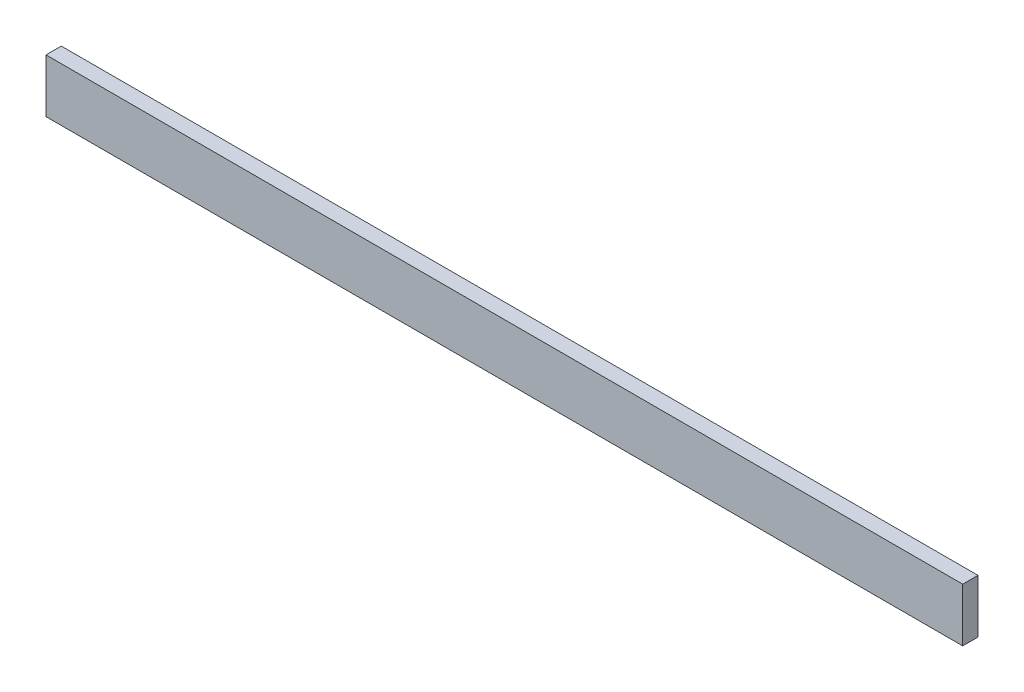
ISO-10303-21;
HEADER;
FILE_DESCRIPTION(('STEP AP214'),'2;1');
FILE_NAME('part.step','',(''),(''),'','','');
FILE_SCHEMA(('AUTOMOTIVE_DESIGN { 1 0 10303 214 1 1 1 1 }'));
ENDSEC;
DATA;
#1=APPLICATION_CONTEXT('core data for automotive mechanical design processes');
#2=APPLICATION_PROTOCOL_DEFINITION('international standard','automotive_design',2000,#1);
#3=PRODUCT_CONTEXT('',#1,'mechanical');
#4=PRODUCT('Part','Part','',(#3));
#5=PRODUCT_RELATED_PRODUCT_CATEGORY('part','',(#4));
#6=PRODUCT_DEFINITION_FORMATION('','',#4);
#7=PRODUCT_DEFINITION_CONTEXT('part definition',#1,'design');
#8=PRODUCT_DEFINITION('design','',#6,#7);
#9=PRODUCT_DEFINITION_SHAPE('','',#8);
#10=(LENGTH_UNIT() NAMED_UNIT(*) SI_UNIT(.MILLI.,.METRE.));
#11=(NAMED_UNIT(*) PLANE_ANGLE_UNIT() SI_UNIT($,.RADIAN.));
#12=(NAMED_UNIT(*) SI_UNIT($,.STERADIAN.) SOLID_ANGLE_UNIT());
#13=UNCERTAINTY_MEASURE_WITH_UNIT(LENGTH_MEASURE(1.E-05),#10,'distance_accuracy_value','');
#14=(GEOMETRIC_REPRESENTATION_CONTEXT(3) GLOBAL_UNCERTAINTY_ASSIGNED_CONTEXT((#13)) GLOBAL_UNIT_ASSIGNED_CONTEXT((#10,
#11,#12)) REPRESENTATION_CONTEXT('',''));
#15=CARTESIAN_POINT('',(0.,0.,0.));
#16=DIRECTION('',(0.,0.,1.));
#17=DIRECTION('',(1.,0.,0.));
#18=AXIS2_PLACEMENT_3D('',#15,#16,#17);
#19=CARTESIAN_POINT('',(-300.,17.5,10.));
#20=DIRECTION('',(1.,0.,0.));
#21=DIRECTION('',(0.,0.,-1.));
#22=AXIS2_PLACEMENT_3D('',#19,#20,#21);
#23=PLANE('',#22);
#24=DIRECTION('',(0.,-1.,0.));
#25=VECTOR('',#24,1.);
#26=CARTESIAN_POINT('',(-300.,17.5,0.));
#27=LINE('',#26,#25);
#28=CARTESIAN_POINT('',(-300.,17.5,0.));
#29=VERTEX_POINT('',#28);
#30=CARTESIAN_POINT('',(-300.,-17.5,0.));
#31=VERTEX_POINT('',#30);
#32=EDGE_CURVE('E98',#29,#31,#27,.T.);
#33=ORIENTED_EDGE('',*,*,#32,.T.);
#34=DIRECTION('',(0.,0.,-1.));
#35=VECTOR('',#34,1.);
#36=CARTESIAN_POINT('',(-300.,-17.5,10.));
#37=LINE('',#36,#35);
#38=CARTESIAN_POINT('',(-300.,-17.5,10.));
#39=VERTEX_POINT('',#38);
#40=EDGE_CURVE('E11',#39,#31,#37,.T.);
#41=ORIENTED_EDGE('',*,*,#40,.F.);
#42=DIRECTION('',(0.,-1.,0.));
#43=VECTOR('',#42,1.);
#44=CARTESIAN_POINT('',(-300.,17.5,10.));
#45=LINE('',#44,#43);
#46=CARTESIAN_POINT('',(-300.,17.5,10.));
#47=VERTEX_POINT('',#46);
#48=EDGE_CURVE('E86',#47,#39,#45,.T.);
#49=ORIENTED_EDGE('',*,*,#48,.F.);
#50=DIRECTION('',(0.,0.,-1.));
#51=VECTOR('',#50,1.);
#52=CARTESIAN_POINT('',(-300.,17.5,10.));
#53=LINE('',#52,#51);
#54=EDGE_CURVE('E94',#47,#29,#53,.T.);
#55=ORIENTED_EDGE('',*,*,#54,.T.);
#56=EDGE_LOOP('',(#33,#41,#49,#55));
#57=FACE_BOUND('',#56,.T.);
#58=ADVANCED_FACE('F35',(#57),#23,.F.);
#59=CARTESIAN_POINT('',(300.,-17.5,10.));
#60=DIRECTION('',(0.,1.,0.));
#61=DIRECTION('',(-1.,0.,0.));
#62=AXIS2_PLACEMENT_3D('',#59,#60,#61);
#63=PLANE('',#62);
#64=DIRECTION('',(1.,0.,0.));
#65=VECTOR('',#64,1.);
#66=CARTESIAN_POINT('',(300.,-17.5,0.));
#67=LINE('',#66,#65);
#68=CARTESIAN_POINT('',(300.,-17.5,0.));
#69=VERTEX_POINT('',#68);
#70=EDGE_CURVE('E90',#31,#69,#67,.T.);
#71=ORIENTED_EDGE('',*,*,#70,.T.);
#72=DIRECTION('',(0.,0.,-1.));
#73=VECTOR('',#72,1.);
#74=CARTESIAN_POINT('',(300.,-17.5,10.));
#75=LINE('',#74,#73);
#76=CARTESIAN_POINT('',(300.,-17.5,10.));
#77=VERTEX_POINT('',#76);
#78=EDGE_CURVE('E43',#77,#69,#75,.T.);
#79=ORIENTED_EDGE('',*,*,#78,.F.);
#80=DIRECTION('',(1.,0.,0.));
#81=VECTOR('',#80,1.);
#82=CARTESIAN_POINT('',(300.,-17.5,10.));
#83=LINE('',#82,#81);
#84=EDGE_CURVE('E81',#39,#77,#83,.T.);
#85=ORIENTED_EDGE('',*,*,#84,.F.);
#86=ORIENTED_EDGE('',*,*,#40,.T.);
#87=EDGE_LOOP('',(#71,#79,#85,#86));
#88=FACE_BOUND('',#87,.T.);
#89=ADVANCED_FACE('F89',(#88),#63,.F.);
#90=CARTESIAN_POINT('',(300.,17.5,10.));
#91=DIRECTION('',(-1.,0.,0.));
#92=DIRECTION('',(0.,0.,1.));
#93=AXIS2_PLACEMENT_3D('',#90,#91,#92);
#94=PLANE('',#93);
#95=DIRECTION('',(0.,1.,0.));
#96=VECTOR('',#95,1.);
#97=CARTESIAN_POINT('',(300.,17.5,0.));
#98=LINE('',#97,#96);
#99=CARTESIAN_POINT('',(300.,17.5,0.));
#100=VERTEX_POINT('',#99);
#101=EDGE_CURVE('E68',#69,#100,#98,.T.);
#102=ORIENTED_EDGE('',*,*,#101,.T.);
#103=DIRECTION('',(0.,0.,-1.));
#104=VECTOR('',#103,1.);
#105=CARTESIAN_POINT('',(300.,17.5,10.));
#106=LINE('',#105,#104);
#107=CARTESIAN_POINT('',(300.,17.5,10.));
#108=VERTEX_POINT('',#107);
#109=EDGE_CURVE('E91',#108,#100,#106,.T.);
#110=ORIENTED_EDGE('',*,*,#109,.F.);
#111=DIRECTION('',(0.,1.,0.));
#112=VECTOR('',#111,1.);
#113=CARTESIAN_POINT('',(300.,17.5,10.));
#114=LINE('',#113,#112);
#115=EDGE_CURVE('E84',#77,#108,#114,.T.);
#116=ORIENTED_EDGE('',*,*,#115,.F.);
#117=ORIENTED_EDGE('',*,*,#78,.T.);
#118=EDGE_LOOP('',(#102,#110,#116,#117));
#119=FACE_BOUND('',#118,.T.);
#120=ADVANCED_FACE('F92',(#119),#94,.F.);
#121=CARTESIAN_POINT('',(300.,17.5,10.));
#122=DIRECTION('',(0.,-1.,0.));
#123=DIRECTION('',(1.,0.,0.));
#124=AXIS2_PLACEMENT_3D('',#121,#122,#123);
#125=PLANE('',#124);
#126=DIRECTION('',(-1.,0.,0.));
#127=VECTOR('',#126,1.);
#128=CARTESIAN_POINT('',(300.,17.5,0.));
#129=LINE('',#128,#127);
#130=EDGE_CURVE('E74',#100,#29,#129,.T.);
#131=ORIENTED_EDGE('',*,*,#130,.T.);
#132=ORIENTED_EDGE('',*,*,#54,.F.);
#133=DIRECTION('',(-1.,0.,0.));
#134=VECTOR('',#133,1.);
#135=CARTESIAN_POINT('',(300.,17.5,10.));
#136=LINE('',#135,#134);
#137=EDGE_CURVE('E51',#108,#47,#136,.T.);
#138=ORIENTED_EDGE('',*,*,#137,.F.);
#139=ORIENTED_EDGE('',*,*,#109,.T.);
#140=EDGE_LOOP('',(#131,#132,#138,#139));
#141=FACE_BOUND('',#140,.T.);
#142=ADVANCED_FACE('F105',(#141),#125,.F.);
#143=CARTESIAN_POINT('',(0.,0.,10.));
#144=DIRECTION('',(0.,0.,-1.));
#145=DIRECTION('',(-1.,0.,0.));
#146=AXIS2_PLACEMENT_3D('',#143,#144,#145);
#147=PLANE('',#146);
#148=ORIENTED_EDGE('',*,*,#48,.T.);
#149=ORIENTED_EDGE('',*,*,#84,.T.);
#150=ORIENTED_EDGE('',*,*,#115,.T.);
#151=ORIENTED_EDGE('',*,*,#137,.T.);
#152=EDGE_LOOP('',(#148,#149,#150,#151));
#153=FACE_BOUND('',#152,.T.);
#154=ADVANCED_FACE('F82',(#153),#147,.F.);
#155=CARTESIAN_POINT('',(0.,0.,0.));
#156=DIRECTION('',(0.,0.,-1.));
#157=DIRECTION('',(-1.,0.,0.));
#158=AXIS2_PLACEMENT_3D('',#155,#156,#157);
#159=PLANE('',#158);
#160=ORIENTED_EDGE('',*,*,#32,.F.);
#161=ORIENTED_EDGE('',*,*,#130,.F.);
#162=ORIENTED_EDGE('',*,*,#101,.F.);
#163=ORIENTED_EDGE('',*,*,#70,.F.);
#164=EDGE_LOOP('',(#160,#161,#162,#163));
#165=FACE_BOUND('',#164,.T.);
#166=ADVANCED_FACE('F108',(#165),#159,.T.);
#167=CLOSED_SHELL('',(#58,#89,#120,#142,#154,#166));
#168=MANIFOLD_SOLID_BREP('B2',#167);
#169=ADVANCED_BREP_SHAPE_REPRESENTATION('',(#18,#168),#14);
#170=SHAPE_DEFINITION_REPRESENTATION(#9,#169);
ENDSEC;
END-ISO-10303-21;
